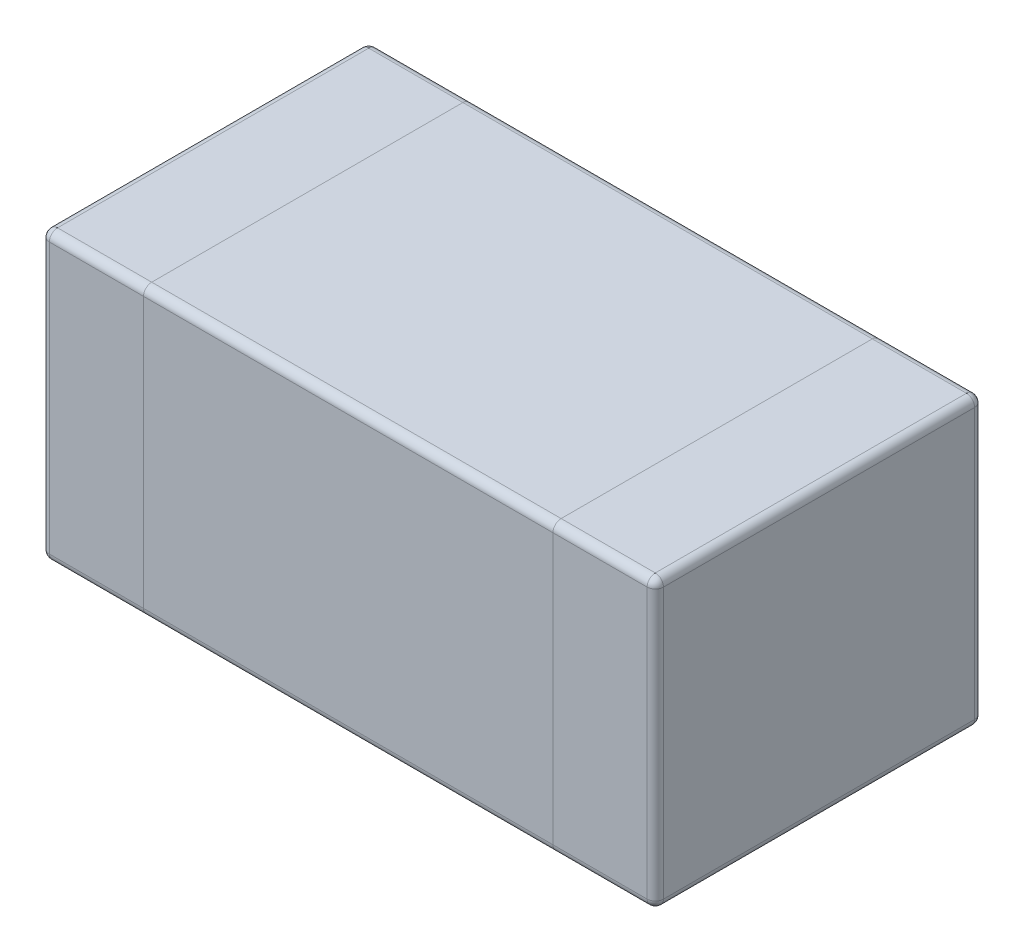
from build123d import *

# Parameters (mm, degrees)
BOSS_EXTRUDE1_DEPTH = 0.35
FILLET2_R           = 0.02


with BuildPart() as part:
    # Sketch1 → Boss-Extrude1 (new, symmetric)
    with BuildSketch(Plane(origin=(0, 0, 0), x_dir=(1, 0, 0), z_dir=(0, 1, 0))):
        with BuildLine():
            Line((-0.73, -0.4), (0.73, -0.4))
            ThreePointArc((0.73, -0.4), (0.744142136, -0.394142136), (0.75, -0.38))
            Line((0.75, -0.38), (0.75, 0.38))
            ThreePointArc((0.75, 0.38), (0.744142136, 0.394142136), (0.73, 0.4))
            Line((0.73, 0.4), (-0.73, 0.4))
            ThreePointArc((-0.73, 0.4), (-0.744142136, 0.394142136), (-0.75, 0.38))
            Line((-0.75, 0.38), (-0.75, -0.38))
            ThreePointArc((-0.75, -0.38), (-0.744142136, -0.394142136), (-0.73, -0.4))
        make_face()
    extrude(amount=BOSS_EXTRUDE1_DEPTH, both=True)

    # Fillet2
    fillet2_edges = [part.edges().sort_by_distance(p)[0] for p in [
        (0.744142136, 0.35, 0.394142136),
        (0, -0.35, 0.4),
        (-0.744142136, -0.35, 0.394142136),
        (0.75, 0.35, 0),
        (0.744142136, 0.35, -0.394142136),
        (0, 0.35, -0.4),
        (-0.744142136, 0.35, -0.394142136),
        (-0.75, 0.35, 0),
        (0, 0.35, 0.4),
        (0, 0.35, -0.4),
        (0, 0.35, -0.4),
        (0, 0.35, 0.4),
        (0, -0.35, 0.4),
        (0, -0.35, 0.4),
        (0, -0.35, -0.4),
        (0, -0.35, -0.4),
        (-0.744142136, 0.35, 0.394142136),
        (0, 0.35, 0.4),
        (-0.75, -0.35, 0),
        (-0.744142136, -0.35, -0.394142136),
        (0, -0.35, -0.4),
        (0.744142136, -0.35, -0.394142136),
        (0.75, -0.35, 0),
        (0.744142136, -0.35, 0.394142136),
    ]]
    fillet(fillet2_edges, radius=FILLET2_R)


solid = part.part
